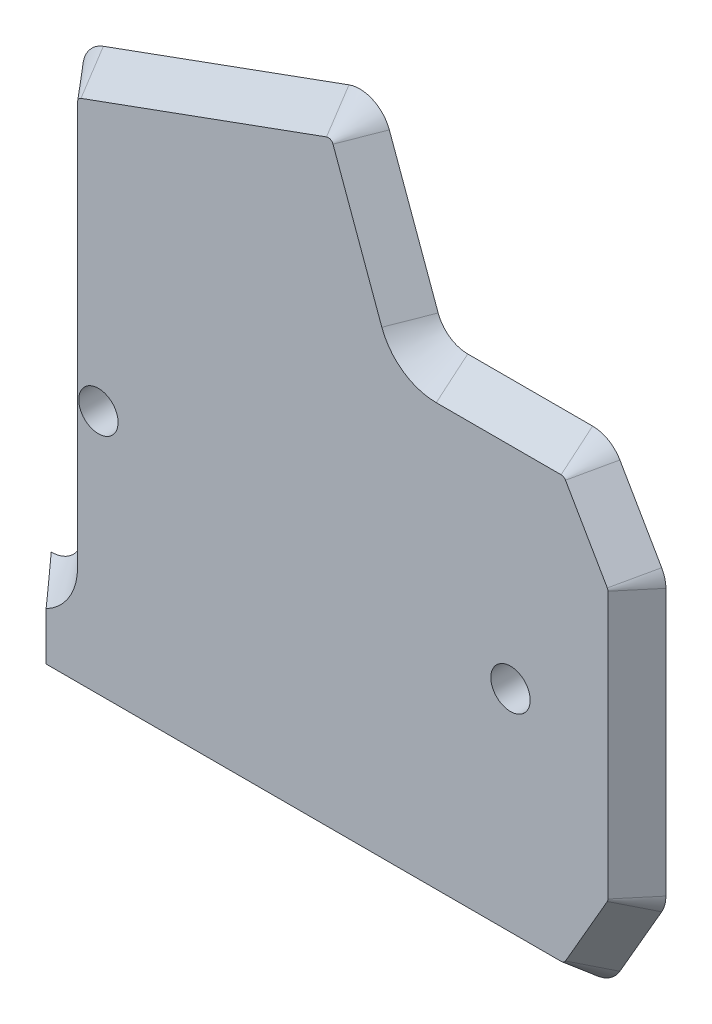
from build123d import *

# Parameters (mm, degrees)
BOSS_EXTRUDE1_DEPTH = 2
BOSS_EXTRUDE1_TAPER = 40
M3_TAPPED_HOLE1_D   = 2.5


with BuildPart() as part:
    # Sketch1 → Boss-Extrude1 (new body)
    with BuildSketch(Plane.XY):
        with BuildLine():
            Line((25.5, -6), (28.674981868, -6))
            Line((28.674981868, -6), (59.889418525, -6))
            ThreePointArc((59.889418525, -6), (60.889418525, -5.732050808), (61.621469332, -5))
            Line((61.621469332, -5), (64.276169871, -0.401923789))
            ThreePointArc((64.276169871, -0.401923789), (64.475970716, 0.080438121), (64.544119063, 0.598076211))
            Line((64.544119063, 0.598076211), (64.544119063, 17.526279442))
            ThreePointArc((64.544119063, 17.526279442), (64.475970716, 18.043917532), (64.276169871, 18.526279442))
            Line((64.276169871, 18.526279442), (61.621469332, 23.124355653))
            ThreePointArc((61.621469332, 23.124355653), (60.889418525, 23.856406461), (59.889418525, 24.124355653))
            Line((59.889418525, 24.124355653), (51.958559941, 24.124355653))
            ThreePointArc((51.958559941, 24.124355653), (50.811407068, 24.486051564), (50.0791747, 25.440315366))
            Line((50.0791747, 25.440315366), (46.977892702, 33.961017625))
            ThreePointArc((46.977892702, 33.961017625), (45.943743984, 35.089592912), (44.414467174, 35.15636258))
            Line((44.414467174, 35.15636258), (28.815959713, 29.478970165))
            ThreePointArc((28.815959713, 29.478970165), (28.744923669, 29.451572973), (28.674981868, 29.421491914))
            ThreePointArc((28.674981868, 29.421491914), (27.819220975, 28.683550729), (27.5, 27.599584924))
            Line((27.5, 27.599584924), (27.5, 2))
            ThreePointArc((27.5, 2), (26.914213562, 0.585786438), (25.5, 0))
            Line((25.5, 0), (25.5, -6))
        make_face()
    extrude(amount=BOSS_EXTRUDE1_DEPTH, taper=BOSS_EXTRUDE1_TAPER)

    # M3 Tapped Hole1 (through all)
    with Locations(Plane.XY.offset(2)):
        with Locations((56.674981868, 9.062177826), (30.5, 11.2558549)):
            Hole(M3_TAPPED_HOLE1_D / 2)


solid = part.part
